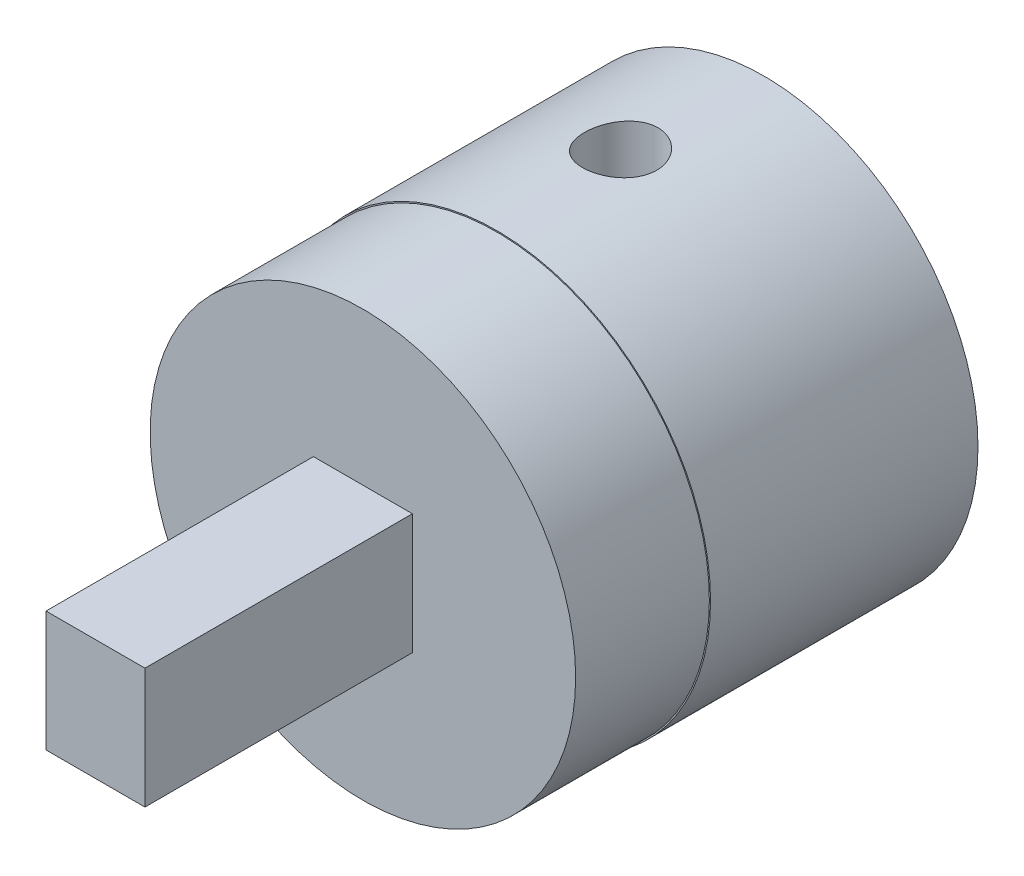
from build123d import *

# Parameters (mm, degrees)
SKETCH2_R               = 8
SKETCH2_R_2             = 3
BOSS_EXTRUDE1_DEPTH     = 10
SKETCH5_R               = 7.955
BOSS_EXTRUDE3_DEPTH     = 5
SKETCH6_W               = 3.7
SKETCH6_H               = 4.5
BOSS_EXTRUDE4_DEPTH     = 10
CUT_EXTRUDE1_DEPTH      = 11
CUT_EXTRUDE1_DEPTH_BACK = 12
SKETCH8_R               = 1.35


with BuildPart() as part:
    # Sketch2 → Boss-Extrude1 (new body)
    with BuildSketch(Plane.XY):
        with Locations((-4.761337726, 0.905324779)):
            Circle(SKETCH2_R)
        with Locations((-4.761337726, 0.905324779)):
            Circle(SKETCH2_R_2, mode=Mode.SUBTRACT)
    extrude(amount=BOSS_EXTRUDE1_DEPTH)

    # Sketch5 → Boss-Extrude3 (add)
    with BuildSketch(Plane.XY.offset(10)):
        with Locations((-4.761337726, 0.905324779)):
            Circle(SKETCH5_R)
    extrude(amount=BOSS_EXTRUDE3_DEPTH)

    # Sketch6 → Boss-Extrude4 (add)
    with BuildSketch(Plane.XY.offset(15)):
        with Locations((-4.761337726, 0.905324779)):
            Rectangle(SKETCH6_W, SKETCH6_H)
    extrude(amount=BOSS_EXTRUDE4_DEPTH)

    # Sketch8 → Cut-Extrude1 (cut, two sides: drawn at the far end of the back side and taken through both)
    with BuildSketch(Plane(origin=(0, 0, 0), x_dir=(1, 0, 0), z_dir=(0, 1, 0)).offset(-CUT_EXTRUDE1_DEPTH_BACK)):
        with Locations(Location((-5.127348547, -5, 0), (0, 0, 270))):
            Circle(SKETCH8_R)
    extrude(amount=CUT_EXTRUDE1_DEPTH + CUT_EXTRUDE1_DEPTH_BACK, mode=Mode.SUBTRACT)


solid = part.part
